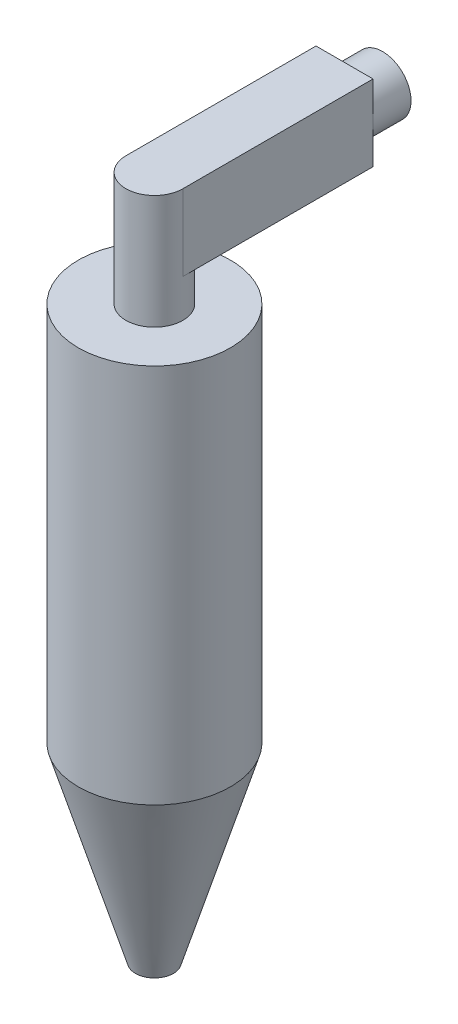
from build123d import *

# Parameters (mm, degrees)
SKETCH_NUZZLE_PATH_R   = 20
SKETCH_NUZZLE_VENT_R   = 5
SKETCH_NUZZLE_NECK_R   = 20
NUZZLE_NECK_DEPTH      = 100
SKETCH_LINKAGE_R       = 7.5
LINKAGE_DEPTH          = 30
SKETCH_LINKAGE_NECK_W  = 15
SKETCH_LINKAGE_NECK_H  = 20
LINKAGE_NECK_DEPTH     = 50
SKETCH_LINKAGE_PIVOT_R = 7.5
LINKAGE_PIVOT_DEPTH    = 10


with BuildPart() as part:
    # Sketch_Nuzzle Path → Loft_Nuzzle section 0
    with BuildSketch(Plane(origin=(0, 50, 0), x_dir=(1, 0, 0), z_dir=(0, 1, 0))):
        Circle(SKETCH_NUZZLE_PATH_R)
    # Sketch_Nuzzle Vent → Loft_Nuzzle section 1
    with BuildSketch(Plane(origin=(0, 0, 0), x_dir=(1, 0, 0), z_dir=(0, 1, 0))):
        Circle(SKETCH_NUZZLE_VENT_R)
    loft()

    # Sketch_Nuzzle Neck → Nuzzle Neck (add)
    with BuildSketch(Plane(origin=(0, 50, 0), x_dir=(1, 0, 0), z_dir=(0, 1, 0))):
        with Locations(Location((0, 0, 0), (0, 0, 270))):
            Circle(SKETCH_NUZZLE_NECK_R)
    extrude(amount=NUZZLE_NECK_DEPTH)

    # Sketch_Linkage → Linkage (add)
    with BuildSketch(Plane(origin=(0, 150, 0), x_dir=(1, 0, 0), z_dir=(0, 1, 0))):
        with Locations(Location((0, 0, 0), (0, 0, 270))):
            Circle(SKETCH_LINKAGE_R)
    extrude(amount=LINKAGE_DEPTH)

    # Sketch_Linkage Neck → Linkage Neck (add)
    with BuildSketch(Plane.XY):
        with Locations((0, 170)):
            Rectangle(SKETCH_LINKAGE_NECK_W, SKETCH_LINKAGE_NECK_H)
    extrude(amount=-LINKAGE_NECK_DEPTH)

    # Sketch_Linkage Pivot → Linkage Pivot (add)
    with BuildSketch(Plane(origin=(0, 0, -50), x_dir=(-1, 0, 0), z_dir=(0, 0, -1))):
        with Locations((0, 170)):
            Circle(SKETCH_LINKAGE_PIVOT_R)
    extrude(amount=LINKAGE_PIVOT_DEPTH)


solid = part.part
